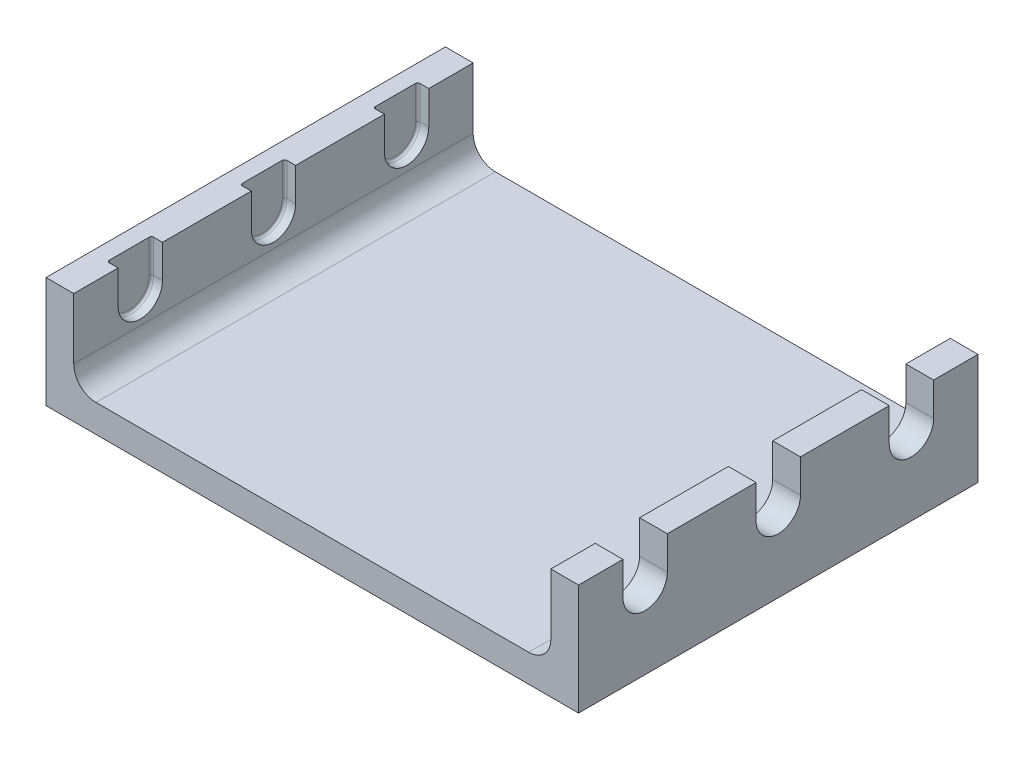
ISO-10303-21;
HEADER;
FILE_DESCRIPTION(('STEP AP214'),'2;1');
FILE_NAME('part.step','',(''),(''),'','','');
FILE_SCHEMA(('AUTOMOTIVE_DESIGN { 1 0 10303 214 1 1 1 1 }'));
ENDSEC;
DATA;
#1=APPLICATION_CONTEXT('core data for automotive mechanical design processes');
#2=APPLICATION_PROTOCOL_DEFINITION('international standard','automotive_design',2000,#1);
#3=PRODUCT_CONTEXT('',#1,'mechanical');
#4=PRODUCT('Part','Part','',(#3));
#5=PRODUCT_RELATED_PRODUCT_CATEGORY('part','',(#4));
#6=PRODUCT_DEFINITION_FORMATION('','',#4);
#7=PRODUCT_DEFINITION_CONTEXT('part definition',#1,'design');
#8=PRODUCT_DEFINITION('design','',#6,#7);
#9=PRODUCT_DEFINITION_SHAPE('','',#8);
#10=(LENGTH_UNIT() NAMED_UNIT(*) SI_UNIT(.MILLI.,.METRE.));
#11=(NAMED_UNIT(*) PLANE_ANGLE_UNIT() SI_UNIT($,.RADIAN.));
#12=(NAMED_UNIT(*) SI_UNIT($,.STERADIAN.) SOLID_ANGLE_UNIT());
#13=UNCERTAINTY_MEASURE_WITH_UNIT(LENGTH_MEASURE(1.E-05),#10,'distance_accuracy_value','');
#14=(GEOMETRIC_REPRESENTATION_CONTEXT(3) GLOBAL_UNCERTAINTY_ASSIGNED_CONTEXT((#13)) GLOBAL_UNIT_ASSIGNED_CONTEXT((#10,
#11,#12)) REPRESENTATION_CONTEXT('',''));
#15=CARTESIAN_POINT('',(0.,0.,0.));
#16=DIRECTION('',(0.,0.,1.));
#17=DIRECTION('',(1.,0.,0.));
#18=AXIS2_PLACEMENT_3D('',#15,#16,#17);
#19=CARTESIAN_POINT('',(273.05,127.,76.2));
#20=DIRECTION('',(0.,-1.,0.));
#21=DIRECTION('',(0.,0.,-1.));
#22=AXIS2_PLACEMENT_3D('',#19,#20,#21);
#23=PLANE('',#22);
#24=DIRECTION('',(0.,0.,-1.));
#25=VECTOR('',#24,1.);
#26=CARTESIAN_POINT('',(273.05,127.,76.2));
#27=LINE('',#26,#25);
#28=CARTESIAN_POINT('',(273.05,127.,-25.4));
#29=VERTEX_POINT('',#28);
#30=CARTESIAN_POINT('',(273.05,127.,-127.));
#31=VERTEX_POINT('',#30);
#32=EDGE_CURVE('E553',#29,#31,#27,.T.);
#33=ORIENTED_EDGE('',*,*,#32,.F.);
#34=DIRECTION('',(1.,0.,0.));
#35=VECTOR('',#34,1.);
#36=CARTESIAN_POINT('',(-304.801,127.,-25.4));
#37=LINE('',#36,#35);
#38=CARTESIAN_POINT('',(304.8,127.,-25.4));
#39=VERTEX_POINT('',#38);
#40=EDGE_CURVE('E487',#29,#39,#37,.T.);
#41=ORIENTED_EDGE('',*,*,#40,.T.);
#42=DIRECTION('',(0.,0.,-1.));
#43=VECTOR('',#42,1.);
#44=CARTESIAN_POINT('',(304.8,127.,76.2));
#45=LINE('',#44,#43);
#46=CARTESIAN_POINT('',(304.8,127.,-127.));
#47=VERTEX_POINT('',#46);
#48=EDGE_CURVE('E557',#39,#47,#45,.T.);
#49=ORIENTED_EDGE('',*,*,#48,.T.);
#50=DIRECTION('',(1.,0.,0.));
#51=VECTOR('',#50,1.);
#52=CARTESIAN_POINT('',(-304.801,127.,-127.));
#53=LINE('',#52,#51);
#54=EDGE_CURVE('E417',#31,#47,#53,.T.);
#55=ORIENTED_EDGE('',*,*,#54,.F.);
#56=EDGE_LOOP('',(#33,#41,#49,#55));
#57=FACE_BOUND('',#56,.T.);
#58=ADVANCED_FACE('F33',(#57),#23,.F.);
#59=CARTESIAN_POINT('',(-304.8,0.,76.2));
#60=DIRECTION('',(1.,0.,0.));
#61=DIRECTION('',(0.,0.,-1.));
#62=AXIS2_PLACEMENT_3D('',#59,#60,#61);
#63=PLANE('',#62);
#64=DIRECTION('',(0.,0.,-1.));
#65=VECTOR('',#64,1.);
#66=CARTESIAN_POINT('',(-304.8,127.,76.2));
#67=LINE('',#66,#65);
#68=CARTESIAN_POINT('',(-304.8,127.,76.2));
#69=VERTEX_POINT('',#68);
#70=CARTESIAN_POINT('',(-304.8,127.,-381.));
#71=VERTEX_POINT('',#70);
#72=EDGE_CURVE('E539',#69,#71,#67,.T.);
#73=ORIENTED_EDGE('',*,*,#72,.T.);
#74=DIRECTION('',(0.,-1.,0.));
#75=VECTOR('',#74,1.);
#76=CARTESIAN_POINT('',(-304.8,0.,-381.));
#77=LINE('',#76,#75);
#78=CARTESIAN_POINT('',(-304.8,0.,-381.));
#79=VERTEX_POINT('',#78);
#80=EDGE_CURVE('E344',#71,#79,#77,.T.);
#81=ORIENTED_EDGE('',*,*,#80,.T.);
#82=DIRECTION('',(0.,0.,-1.));
#83=VECTOR('',#82,1.);
#84=CARTESIAN_POINT('',(-304.8,0.,76.2));
#85=LINE('',#84,#83);
#86=CARTESIAN_POINT('',(-304.8,0.,76.2));
#87=VERTEX_POINT('',#86);
#88=EDGE_CURVE('E563',#87,#79,#85,.T.);
#89=ORIENTED_EDGE('',*,*,#88,.F.);
#90=DIRECTION('',(0.,-1.,0.));
#91=VECTOR('',#90,1.);
#92=CARTESIAN_POINT('',(-304.8,0.,76.2));
#93=LINE('',#92,#91);
#94=EDGE_CURVE('E513',#69,#87,#93,.T.);
#95=ORIENTED_EDGE('',*,*,#94,.F.);
#96=EDGE_LOOP('',(#73,#81,#89,#95));
#97=FACE_BOUND('',#96,.T.);
#98=ADVANCED_FACE('F688',(#97),#63,.F.);
#99=CARTESIAN_POINT('',(-304.8,0.,76.2));
#100=DIRECTION('',(0.,1.,0.));
#101=DIRECTION('',(0.,0.,1.));
#102=AXIS2_PLACEMENT_3D('',#99,#100,#101);
#103=PLANE('',#102);
#104=ORIENTED_EDGE('',*,*,#88,.T.);
#105=DIRECTION('',(1.,0.,0.));
#106=VECTOR('',#105,1.);
#107=CARTESIAN_POINT('',(-304.8,0.,-381.));
#108=LINE('',#107,#106);
#109=CARTESIAN_POINT('',(304.8,0.,-381.));
#110=VERTEX_POINT('',#109);
#111=EDGE_CURVE('E353',#79,#110,#108,.T.);
#112=ORIENTED_EDGE('',*,*,#111,.T.);
#113=DIRECTION('',(0.,0.,-1.));
#114=VECTOR('',#113,1.);
#115=CARTESIAN_POINT('',(304.8,0.,76.2));
#116=LINE('',#115,#114);
#117=CARTESIAN_POINT('',(304.8,0.,76.2));
#118=VERTEX_POINT('',#117);
#119=EDGE_CURVE('E561',#118,#110,#116,.T.);
#120=ORIENTED_EDGE('',*,*,#119,.F.);
#121=DIRECTION('',(1.,0.,0.));
#122=VECTOR('',#121,1.);
#123=CARTESIAN_POINT('',(-304.8,0.,76.2));
#124=LINE('',#123,#122);
#125=EDGE_CURVE('E521',#87,#118,#124,.T.);
#126=ORIENTED_EDGE('',*,*,#125,.F.);
#127=EDGE_LOOP('',(#104,#112,#120,#126));
#128=FACE_BOUND('',#127,.T.);
#129=ADVANCED_FACE('F726',(#128),#103,.F.);
#130=CARTESIAN_POINT('',(304.8,0.,76.2));
#131=DIRECTION('',(-1.,0.,0.));
#132=DIRECTION('',(0.,0.,1.));
#133=AXIS2_PLACEMENT_3D('',#130,#131,#132);
#134=PLANE('',#133);
#135=ORIENTED_EDGE('',*,*,#48,.F.);
#136=DIRECTION('',(0.,1.,0.));
#137=VECTOR('',#136,1.);
#138=CARTESIAN_POINT('',(304.8,88.9,-25.4));
#139=LINE('',#138,#137);
#140=CARTESIAN_POINT('',(304.8,88.9,-25.4));
#141=VERTEX_POINT('',#140);
#142=EDGE_CURVE('E484',#141,#39,#139,.T.);
#143=ORIENTED_EDGE('',*,*,#142,.F.);
#144=CARTESIAN_POINT('',(304.8,88.9,0.));
#145=DIRECTION('',(1.,0.,0.));
#146=DIRECTION('',(0.,0.,-1.));
#147=AXIS2_PLACEMENT_3D('',#144,#145,#146);
#148=CIRCLE('',#147,25.4);
#149=CARTESIAN_POINT('',(304.8,88.9,25.4));
#150=VERTEX_POINT('',#149);
#151=EDGE_CURVE('E481',#150,#141,#148,.T.);
#152=ORIENTED_EDGE('',*,*,#151,.F.);
#153=DIRECTION('',(0.,-1.,0.));
#154=VECTOR('',#153,1.);
#155=CARTESIAN_POINT('',(304.8,127.,25.4));
#156=LINE('',#155,#154);
#157=CARTESIAN_POINT('',(304.8,127.,25.4));
#158=VERTEX_POINT('',#157);
#159=EDGE_CURVE('E478',#158,#150,#156,.T.);
#160=ORIENTED_EDGE('',*,*,#159,.F.);
#161=CARTESIAN_POINT('',(304.8,127.,76.2));
#162=VERTEX_POINT('',#161);
#163=EDGE_CURVE('E558',#162,#158,#45,.T.);
#164=ORIENTED_EDGE('',*,*,#163,.F.);
#165=DIRECTION('',(0.,1.,0.));
#166=VECTOR('',#165,1.);
#167=CARTESIAN_POINT('',(304.8,0.,76.2));
#168=LINE('',#167,#166);
#169=EDGE_CURVE('E523',#118,#162,#168,.T.);
#170=ORIENTED_EDGE('',*,*,#169,.F.);
#171=ORIENTED_EDGE('',*,*,#119,.T.);
#172=DIRECTION('',(0.,1.,0.));
#173=VECTOR('',#172,1.);
#174=CARTESIAN_POINT('',(304.8,0.,-381.));
#175=LINE('',#174,#173);
#176=CARTESIAN_POINT('',(304.8,127.,-381.));
#177=VERTEX_POINT('',#176);
#178=EDGE_CURVE('E356',#110,#177,#175,.T.);
#179=ORIENTED_EDGE('',*,*,#178,.T.);
#180=DIRECTION('',(0.,0.,-1.));
#181=VECTOR('',#180,1.);
#182=CARTESIAN_POINT('',(304.8,127.,-228.6));
#183=LINE('',#182,#181);
#184=CARTESIAN_POINT('',(304.8,127.,-330.2));
#185=VERTEX_POINT('',#184);
#186=EDGE_CURVE('E384',#185,#177,#183,.T.);
#187=ORIENTED_EDGE('',*,*,#186,.F.);
#188=DIRECTION('',(0.,1.,0.));
#189=VECTOR('',#188,1.);
#190=CARTESIAN_POINT('',(304.8,88.9,-330.2));
#191=LINE('',#190,#189);
#192=CARTESIAN_POINT('',(304.8,88.9,-330.2));
#193=VERTEX_POINT('',#192);
#194=EDGE_CURVE('E320',#193,#185,#191,.T.);
#195=ORIENTED_EDGE('',*,*,#194,.F.);
#196=CARTESIAN_POINT('',(304.8,88.9,-304.8));
#197=DIRECTION('',(1.,0.,0.));
#198=DIRECTION('',(0.,0.,-1.));
#199=AXIS2_PLACEMENT_3D('',#196,#197,#198);
#200=CIRCLE('',#199,25.4);
#201=CARTESIAN_POINT('',(304.8,88.9,-279.4));
#202=VERTEX_POINT('',#201);
#203=EDGE_CURVE('E324',#202,#193,#200,.T.);
#204=ORIENTED_EDGE('',*,*,#203,.F.);
#205=DIRECTION('',(0.,-1.,0.));
#206=VECTOR('',#205,1.);
#207=CARTESIAN_POINT('',(304.8,127.,-279.4));
#208=LINE('',#207,#206);
#209=CARTESIAN_POINT('',(304.8,127.,-279.4));
#210=VERTEX_POINT('',#209);
#211=EDGE_CURVE('E772',#210,#202,#208,.T.);
#212=ORIENTED_EDGE('',*,*,#211,.F.);
#213=DIRECTION('',(0.,0.,-1.));
#214=VECTOR('',#213,1.);
#215=CARTESIAN_POINT('',(304.8,127.,-76.2));
#216=LINE('',#215,#214);
#217=CARTESIAN_POINT('',(304.8,127.,-177.8));
#218=VERTEX_POINT('',#217);
#219=EDGE_CURVE('E304',#218,#210,#216,.T.);
#220=ORIENTED_EDGE('',*,*,#219,.F.);
#221=DIRECTION('',(0.,1.,0.));
#222=VECTOR('',#221,1.);
#223=CARTESIAN_POINT('',(304.8,88.9,-177.8));
#224=LINE('',#223,#222);
#225=CARTESIAN_POINT('',(304.8,88.9,-177.8));
#226=VERTEX_POINT('',#225);
#227=EDGE_CURVE('E415',#226,#218,#224,.T.);
#228=ORIENTED_EDGE('',*,*,#227,.F.);
#229=CARTESIAN_POINT('',(304.8,88.9,-152.4));
#230=DIRECTION('',(1.,0.,0.));
#231=DIRECTION('',(0.,0.,-1.));
#232=AXIS2_PLACEMENT_3D('',#229,#230,#231);
#233=CIRCLE('',#232,25.4);
#234=CARTESIAN_POINT('',(304.8,88.9,-127.));
#235=VERTEX_POINT('',#234);
#236=EDGE_CURVE('E412',#235,#226,#233,.T.);
#237=ORIENTED_EDGE('',*,*,#236,.F.);
#238=DIRECTION('',(0.,-1.,0.));
#239=VECTOR('',#238,1.);
#240=CARTESIAN_POINT('',(304.8,127.,-127.));
#241=LINE('',#240,#239);
#242=EDGE_CURVE('E409',#47,#235,#241,.T.);
#243=ORIENTED_EDGE('',*,*,#242,.F.);
#244=EDGE_LOOP('',(#135,#143,#152,#160,#164,#170,#171,#179,#187,#195,#204,#212,#220,#228,#237,#243));
#245=FACE_BOUND('',#244,.T.);
#246=ADVANCED_FACE('F722',(#245),#134,.F.);
#247=ORIENTED_EDGE('',*,*,#163,.T.);
#248=DIRECTION('',(1.,0.,0.));
#249=VECTOR('',#248,1.);
#250=CARTESIAN_POINT('',(-304.801,127.,25.4));
#251=LINE('',#250,#249);
#252=CARTESIAN_POINT('',(273.05,127.,25.4));
#253=VERTEX_POINT('',#252);
#254=EDGE_CURVE('E486',#253,#158,#251,.T.);
#255=ORIENTED_EDGE('',*,*,#254,.F.);
#256=CARTESIAN_POINT('',(273.05,127.,76.2));
#257=VERTEX_POINT('',#256);
#258=EDGE_CURVE('E554',#257,#253,#27,.T.);
#259=ORIENTED_EDGE('',*,*,#258,.F.);
#260=DIRECTION('',(-1.,0.,0.));
#261=VECTOR('',#260,1.);
#262=CARTESIAN_POINT('',(273.05,127.,76.2));
#263=LINE('',#262,#261);
#264=EDGE_CURVE('E525',#162,#257,#263,.T.);
#265=ORIENTED_EDGE('',*,*,#264,.F.);
#266=EDGE_LOOP('',(#247,#255,#259,#265));
#267=FACE_BOUND('',#266,.T.);
#268=ADVANCED_FACE('F733',(#267),#23,.F.);
#269=CARTESIAN_POINT('',(273.05,57.15,76.2));
#270=DIRECTION('',(1.,0.,0.));
#271=DIRECTION('',(0.,0.,-1.));
#272=AXIS2_PLACEMENT_3D('',#269,#270,#271);
#273=PLANE('',#272);
#274=CARTESIAN_POINT('',(273.05,88.9,0.));
#275=DIRECTION('',(1.,0.,0.));
#276=DIRECTION('',(0.,0.,-1.));
#277=AXIS2_PLACEMENT_3D('',#274,#275,#276);
#278=CIRCLE('',#277,25.4);
#279=CARTESIAN_POINT('',(273.05,88.9,-25.4));
#280=VERTEX_POINT('',#279);
#281=CARTESIAN_POINT('',(273.05,88.9,25.4));
#282=VERTEX_POINT('',#281);
#283=EDGE_CURVE('E50',#280,#282,#278,.F.);
#284=ORIENTED_EDGE('',*,*,#283,.F.);
#285=DIRECTION('',(0.,-1.,0.));
#286=VECTOR('',#285,1.);
#287=CARTESIAN_POINT('',(273.05,88.9,-25.4));
#288=LINE('',#287,#286);
#289=EDGE_CURVE('E475',#29,#280,#288,.T.);
#290=ORIENTED_EDGE('',*,*,#289,.F.);
#291=ORIENTED_EDGE('',*,*,#32,.T.);
#292=DIRECTION('',(0.,1.,0.));
#293=VECTOR('',#292,1.);
#294=CARTESIAN_POINT('',(273.05,127.,-127.));
#295=LINE('',#294,#293);
#296=CARTESIAN_POINT('',(273.05,88.9,-127.));
#297=VERTEX_POINT('',#296);
#298=EDGE_CURVE('E420',#297,#31,#295,.T.);
#299=ORIENTED_EDGE('',*,*,#298,.F.);
#300=CARTESIAN_POINT('',(273.05,88.9,-152.4));
#301=DIRECTION('',(1.,0.,0.));
#302=DIRECTION('',(0.,0.,-1.));
#303=AXIS2_PLACEMENT_3D('',#300,#301,#302);
#304=CIRCLE('',#303,25.4);
#305=CARTESIAN_POINT('',(273.05,88.9,-177.8));
#306=VERTEX_POINT('',#305);
#307=EDGE_CURVE('E403',#306,#297,#304,.F.);
#308=ORIENTED_EDGE('',*,*,#307,.F.);
#309=DIRECTION('',(0.,-1.,0.));
#310=VECTOR('',#309,1.);
#311=CARTESIAN_POINT('',(273.05,88.9,-177.8));
#312=LINE('',#311,#310);
#313=CARTESIAN_POINT('',(273.05,127.,-177.8));
#314=VERTEX_POINT('',#313);
#315=EDGE_CURVE('E300',#314,#306,#312,.T.);
#316=ORIENTED_EDGE('',*,*,#315,.F.);
#317=DIRECTION('',(0.,0.,-1.));
#318=VECTOR('',#317,1.);
#319=CARTESIAN_POINT('',(273.05,127.,-76.2));
#320=LINE('',#319,#318);
#321=CARTESIAN_POINT('',(273.05,127.,-279.4));
#322=VERTEX_POINT('',#321);
#323=EDGE_CURVE('E293',#314,#322,#320,.T.);
#324=ORIENTED_EDGE('',*,*,#323,.T.);
#325=DIRECTION('',(0.,1.,0.));
#326=VECTOR('',#325,1.);
#327=CARTESIAN_POINT('',(273.05,127.,-279.4));
#328=LINE('',#327,#326);
#329=CARTESIAN_POINT('',(273.05,88.9,-279.4));
#330=VERTEX_POINT('',#329);
#331=EDGE_CURVE('E297',#330,#322,#328,.T.);
#332=ORIENTED_EDGE('',*,*,#331,.F.);
#333=CARTESIAN_POINT('',(273.05,88.9,-304.8));
#334=DIRECTION('',(1.,0.,0.));
#335=DIRECTION('',(0.,0.,-1.));
#336=AXIS2_PLACEMENT_3D('',#333,#334,#335);
#337=CIRCLE('',#336,25.4);
#338=CARTESIAN_POINT('',(273.05,88.9,-330.2));
#339=VERTEX_POINT('',#338);
#340=EDGE_CURVE('E778',#339,#330,#337,.F.);
#341=ORIENTED_EDGE('',*,*,#340,.F.);
#342=DIRECTION('',(0.,-1.,0.));
#343=VECTOR('',#342,1.);
#344=CARTESIAN_POINT('',(273.05,88.9,-330.2));
#345=LINE('',#344,#343);
#346=CARTESIAN_POINT('',(273.05,127.,-330.2));
#347=VERTEX_POINT('',#346);
#348=EDGE_CURVE('E774',#347,#339,#345,.T.);
#349=ORIENTED_EDGE('',*,*,#348,.F.);
#350=DIRECTION('',(0.,0.,-1.));
#351=VECTOR('',#350,1.);
#352=CARTESIAN_POINT('',(273.05,127.,-228.6));
#353=LINE('',#352,#351);
#354=CARTESIAN_POINT('',(273.05,127.,-381.));
#355=VERTEX_POINT('',#354);
#356=EDGE_CURVE('E382',#347,#355,#353,.T.);
#357=ORIENTED_EDGE('',*,*,#356,.T.);
#358=DIRECTION('',(0.,-1.,0.));
#359=VECTOR('',#358,1.);
#360=CARTESIAN_POINT('',(273.05,57.15,-381.));
#361=LINE('',#360,#359);
#362=CARTESIAN_POINT('',(273.05,57.15,-381.));
#363=VERTEX_POINT('',#362);
#364=EDGE_CURVE('E362',#355,#363,#361,.T.);
#365=ORIENTED_EDGE('',*,*,#364,.T.);
#366=DIRECTION('',(0.,0.,-1.));
#367=VECTOR('',#366,1.);
#368=CARTESIAN_POINT('',(273.05,57.15,76.2));
#369=LINE('',#368,#367);
#370=CARTESIAN_POINT('',(273.05,57.15,76.2));
#371=VERTEX_POINT('',#370);
#372=EDGE_CURVE('E551',#371,#363,#369,.T.);
#373=ORIENTED_EDGE('',*,*,#372,.F.);
#374=DIRECTION('',(0.,-1.,0.));
#375=VECTOR('',#374,1.);
#376=CARTESIAN_POINT('',(273.05,57.15,76.2));
#377=LINE('',#376,#375);
#378=EDGE_CURVE('E527',#257,#371,#377,.T.);
#379=ORIENTED_EDGE('',*,*,#378,.F.);
#380=ORIENTED_EDGE('',*,*,#258,.T.);
#381=DIRECTION('',(0.,1.,0.));
#382=VECTOR('',#381,1.);
#383=CARTESIAN_POINT('',(273.05,127.,25.4));
#384=LINE('',#383,#382);
#385=EDGE_CURVE('E490',#282,#253,#384,.T.);
#386=ORIENTED_EDGE('',*,*,#385,.F.);
#387=EDGE_LOOP('',(#284,#290,#291,#299,#308,#316,#324,#332,#341,#349,#357,#365,#373,#379,#380,#386));
#388=FACE_BOUND('',#387,.T.);
#389=ADVANCED_FACE('F295',(#388),#273,.F.);
#390=CARTESIAN_POINT('',(247.65,57.15,76.2));
#391=DIRECTION('',(0.,0.,-1.));
#392=DIRECTION('',(-1.,0.,0.));
#393=AXIS2_PLACEMENT_3D('',#390,#391,#392);
#394=CYLINDRICAL_SURFACE('',#393,25.4);
#395=ORIENTED_EDGE('',*,*,#372,.T.);
#396=CARTESIAN_POINT('',(247.65,57.15,-381.));
#397=DIRECTION('',(0.,0.,-1.));
#398=DIRECTION('',(-1.,0.,0.));
#399=AXIS2_PLACEMENT_3D('',#396,#397,#398);
#400=CIRCLE('',#399,25.4);
#401=CARTESIAN_POINT('',(247.65,31.75,-381.));
#402=VERTEX_POINT('',#401);
#403=EDGE_CURVE('E365',#363,#402,#400,.T.);
#404=ORIENTED_EDGE('',*,*,#403,.T.);
#405=DIRECTION('',(0.,0.,-1.));
#406=VECTOR('',#405,1.);
#407=CARTESIAN_POINT('',(247.65,31.75,76.2));
#408=LINE('',#407,#406);
#409=CARTESIAN_POINT('',(247.65,31.75,76.2));
#410=VERTEX_POINT('',#409);
#411=EDGE_CURVE('E549',#410,#402,#408,.T.);
#412=ORIENTED_EDGE('',*,*,#411,.F.);
#413=CARTESIAN_POINT('',(247.65,57.15,76.2));
#414=DIRECTION('',(0.,0.,-1.));
#415=DIRECTION('',(-1.,0.,0.));
#416=AXIS2_PLACEMENT_3D('',#413,#414,#415);
#417=CIRCLE('',#416,25.4);
#418=EDGE_CURVE('E529',#371,#410,#417,.T.);
#419=ORIENTED_EDGE('',*,*,#418,.F.);
#420=EDGE_LOOP('',(#395,#404,#412,#419));
#421=FACE_BOUND('',#420,.T.);
#422=ADVANCED_FACE('F709',(#421),#394,.F.);
#423=CARTESIAN_POINT('',(-247.65,31.75,76.2));
#424=DIRECTION('',(0.,-1.,0.));
#425=DIRECTION('',(0.,0.,-1.));
#426=AXIS2_PLACEMENT_3D('',#423,#424,#425);
#427=PLANE('',#426);
#428=ORIENTED_EDGE('',*,*,#411,.T.);
#429=DIRECTION('',(-1.,0.,0.));
#430=VECTOR('',#429,1.);
#431=CARTESIAN_POINT('',(-247.65,31.75,-381.));
#432=LINE('',#431,#430);
#433=CARTESIAN_POINT('',(-247.65,31.75,-381.));
#434=VERTEX_POINT('',#433);
#435=EDGE_CURVE('E368',#402,#434,#432,.T.);
#436=ORIENTED_EDGE('',*,*,#435,.T.);
#437=DIRECTION('',(0.,0.,-1.));
#438=VECTOR('',#437,1.);
#439=CARTESIAN_POINT('',(-247.65,31.75,76.2));
#440=LINE('',#439,#438);
#441=CARTESIAN_POINT('',(-247.65,31.75,76.2));
#442=VERTEX_POINT('',#441);
#443=EDGE_CURVE('E547',#442,#434,#440,.T.);
#444=ORIENTED_EDGE('',*,*,#443,.F.);
#445=DIRECTION('',(-1.,0.,0.));
#446=VECTOR('',#445,1.);
#447=CARTESIAN_POINT('',(-247.65,31.75,76.2));
#448=LINE('',#447,#446);
#449=EDGE_CURVE('E531',#410,#442,#448,.T.);
#450=ORIENTED_EDGE('',*,*,#449,.F.);
#451=EDGE_LOOP('',(#428,#436,#444,#450));
#452=FACE_BOUND('',#451,.T.);
#453=ADVANCED_FACE('F704',(#452),#427,.F.);
#454=CARTESIAN_POINT('',(-247.65,57.15,76.2));
#455=DIRECTION('',(0.,0.,-1.));
#456=DIRECTION('',(-1.,0.,0.));
#457=AXIS2_PLACEMENT_3D('',#454,#455,#456);
#458=CYLINDRICAL_SURFACE('',#457,25.4);
#459=ORIENTED_EDGE('',*,*,#443,.T.);
#460=CARTESIAN_POINT('',(-247.65,57.15,-381.));
#461=DIRECTION('',(0.,0.,-1.));
#462=DIRECTION('',(-1.,0.,0.));
#463=AXIS2_PLACEMENT_3D('',#460,#461,#462);
#464=CIRCLE('',#463,25.4);
#465=CARTESIAN_POINT('',(-273.05,57.15,-381.));
#466=VERTEX_POINT('',#465);
#467=EDGE_CURVE('E371',#434,#466,#464,.T.);
#468=ORIENTED_EDGE('',*,*,#467,.T.);
#469=DIRECTION('',(0.,0.,-1.));
#470=VECTOR('',#469,1.);
#471=CARTESIAN_POINT('',(-273.05,57.15,76.2));
#472=LINE('',#471,#470);
#473=CARTESIAN_POINT('',(-273.05,57.15,76.2));
#474=VERTEX_POINT('',#473);
#475=EDGE_CURVE('E545',#474,#466,#472,.T.);
#476=ORIENTED_EDGE('',*,*,#475,.F.);
#477=CARTESIAN_POINT('',(-247.65,57.15,76.2));
#478=DIRECTION('',(0.,0.,-1.));
#479=DIRECTION('',(-1.,0.,0.));
#480=AXIS2_PLACEMENT_3D('',#477,#478,#479);
#481=CIRCLE('',#480,25.4);
#482=EDGE_CURVE('E533',#442,#474,#481,.T.);
#483=ORIENTED_EDGE('',*,*,#482,.F.);
#484=EDGE_LOOP('',(#459,#468,#476,#483));
#485=FACE_BOUND('',#484,.T.);
#486=ADVANCED_FACE('F698',(#485),#458,.F.);
#487=CARTESIAN_POINT('',(-273.05,57.15,76.2));
#488=DIRECTION('',(-1.,0.,0.));
#489=DIRECTION('',(0.,0.,1.));
#490=AXIS2_PLACEMENT_3D('',#487,#488,#489);
#491=PLANE('',#490);
#492=DIRECTION('',(0.,0.,-1.));
#493=VECTOR('',#492,1.);
#494=CARTESIAN_POINT('',(-273.05,127.,76.2));
#495=LINE('',#494,#493);
#496=CARTESIAN_POINT('',(-273.05,127.,-25.4));
#497=VERTEX_POINT('',#496);
#498=CARTESIAN_POINT('',(-273.05,127.,-127.));
#499=VERTEX_POINT('',#498);
#500=EDGE_CURVE('E541',#497,#499,#495,.T.);
#501=ORIENTED_EDGE('',*,*,#500,.F.);
#502=DIRECTION('',(0.,1.,0.));
#503=VECTOR('',#502,1.);
#504=CARTESIAN_POINT('',(-273.05,88.9,-25.4));
#505=LINE('',#504,#503);
#506=CARTESIAN_POINT('',(-273.05,88.9,-25.4));
#507=VERTEX_POINT('',#506);
#508=EDGE_CURVE('E502',#507,#497,#505,.T.);
#509=ORIENTED_EDGE('',*,*,#508,.F.);
#510=CARTESIAN_POINT('',(-273.05,88.9,0.));
#511=DIRECTION('',(1.,0.,0.));
#512=DIRECTION('',(0.,0.,-1.));
#513=AXIS2_PLACEMENT_3D('',#510,#511,#512);
#514=CIRCLE('',#513,25.4);
#515=CARTESIAN_POINT('',(-273.05,88.9,25.4));
#516=VERTEX_POINT('',#515);
#517=EDGE_CURVE('E506',#516,#507,#514,.T.);
#518=ORIENTED_EDGE('',*,*,#517,.F.);
#519=DIRECTION('',(0.,-1.,0.));
#520=VECTOR('',#519,1.);
#521=CARTESIAN_POINT('',(-273.05,127.,25.4));
#522=LINE('',#521,#520);
#523=CARTESIAN_POINT('',(-273.05,127.,25.4));
#524=VERTEX_POINT('',#523);
#525=EDGE_CURVE('E503',#524,#516,#522,.T.);
#526=ORIENTED_EDGE('',*,*,#525,.F.);
#527=CARTESIAN_POINT('',(-273.05,127.,76.2));
#528=VERTEX_POINT('',#527);
#529=EDGE_CURVE('E542',#528,#524,#495,.T.);
#530=ORIENTED_EDGE('',*,*,#529,.F.);
#531=DIRECTION('',(0.,1.,0.));
#532=VECTOR('',#531,1.);
#533=CARTESIAN_POINT('',(-273.05,57.15,76.2));
#534=LINE('',#533,#532);
#535=EDGE_CURVE('E535',#474,#528,#534,.T.);
#536=ORIENTED_EDGE('',*,*,#535,.F.);
#537=ORIENTED_EDGE('',*,*,#475,.T.);
#538=DIRECTION('',(0.,1.,0.));
#539=VECTOR('',#538,1.);
#540=CARTESIAN_POINT('',(-273.05,57.15,-381.));
#541=LINE('',#540,#539);
#542=CARTESIAN_POINT('',(-273.05,127.,-381.));
#543=VERTEX_POINT('',#542);
#544=EDGE_CURVE('E374',#466,#543,#541,.T.);
#545=ORIENTED_EDGE('',*,*,#544,.T.);
#546=DIRECTION('',(0.,0.,-1.));
#547=VECTOR('',#546,1.);
#548=CARTESIAN_POINT('',(-273.05,127.,-228.6));
#549=LINE('',#548,#547);
#550=CARTESIAN_POINT('',(-273.05,127.,-330.2));
#551=VERTEX_POINT('',#550);
#552=EDGE_CURVE('E380',#551,#543,#549,.T.);
#553=ORIENTED_EDGE('',*,*,#552,.F.);
#554=DIRECTION('',(0.,1.,0.));
#555=VECTOR('',#554,1.);
#556=CARTESIAN_POINT('',(-273.05,88.9,-330.2));
#557=LINE('',#556,#555);
#558=CARTESIAN_POINT('',(-273.05,88.9,-330.2));
#559=VERTEX_POINT('',#558);
#560=EDGE_CURVE('E332',#559,#551,#557,.T.);
#561=ORIENTED_EDGE('',*,*,#560,.F.);
#562=CARTESIAN_POINT('',(-273.05,88.9,-304.8));
#563=DIRECTION('',(1.,0.,0.));
#564=DIRECTION('',(0.,0.,-1.));
#565=AXIS2_PLACEMENT_3D('',#562,#563,#564);
#566=CIRCLE('',#565,25.4);
#567=CARTESIAN_POINT('',(-273.05,88.9,-279.4));
#568=VERTEX_POINT('',#567);
#569=EDGE_CURVE('E336',#568,#559,#566,.T.);
#570=ORIENTED_EDGE('',*,*,#569,.F.);
#571=DIRECTION('',(0.,-1.,0.));
#572=VECTOR('',#571,1.);
#573=CARTESIAN_POINT('',(-273.05,127.,-279.4));
#574=LINE('',#573,#572);
#575=CARTESIAN_POINT('',(-273.05,127.,-279.4));
#576=VERTEX_POINT('',#575);
#577=EDGE_CURVE('E333',#576,#568,#574,.T.);
#578=ORIENTED_EDGE('',*,*,#577,.F.);
#579=DIRECTION('',(0.,0.,-1.));
#580=VECTOR('',#579,1.);
#581=CARTESIAN_POINT('',(-273.05,127.,-76.2));
#582=LINE('',#581,#580);
#583=CARTESIAN_POINT('',(-273.05,127.,-177.8));
#584=VERTEX_POINT('',#583);
#585=EDGE_CURVE('E305',#584,#576,#582,.T.);
#586=ORIENTED_EDGE('',*,*,#585,.F.);
#587=DIRECTION('',(0.,1.,0.));
#588=VECTOR('',#587,1.);
#589=CARTESIAN_POINT('',(-273.05,88.9,-177.8));
#590=LINE('',#589,#588);
#591=CARTESIAN_POINT('',(-273.05,88.9,-177.8));
#592=VERTEX_POINT('',#591);
#593=EDGE_CURVE('E434',#592,#584,#590,.T.);
#594=ORIENTED_EDGE('',*,*,#593,.F.);
#595=CARTESIAN_POINT('',(-273.05,88.9,-152.4));
#596=DIRECTION('',(1.,0.,0.));
#597=DIRECTION('',(0.,0.,-1.));
#598=AXIS2_PLACEMENT_3D('',#595,#596,#597);
#599=CIRCLE('',#598,25.4);
#600=CARTESIAN_POINT('',(-273.05,88.9,-127.));
#601=VERTEX_POINT('',#600);
#602=EDGE_CURVE('E438',#601,#592,#599,.T.);
#603=ORIENTED_EDGE('',*,*,#602,.F.);
#604=DIRECTION('',(0.,-1.,0.));
#605=VECTOR('',#604,1.);
#606=CARTESIAN_POINT('',(-273.05,127.,-127.));
#607=LINE('',#606,#605);
#608=EDGE_CURVE('E435',#499,#601,#607,.T.);
#609=ORIENTED_EDGE('',*,*,#608,.F.);
#610=EDGE_LOOP('',(#501,#509,#518,#526,#530,#536,#537,#545,#553,#561,#570,#578,#586,#594,#603,#609));
#611=FACE_BOUND('',#610,.T.);
#612=ADVANCED_FACE('F610',(#611),#491,.F.);
#613=CARTESIAN_POINT('',(-304.8,127.,76.2));
#614=DIRECTION('',(0.,-1.,0.));
#615=DIRECTION('',(0.,0.,-1.));
#616=AXIS2_PLACEMENT_3D('',#613,#614,#615);
#617=PLANE('',#616);
#618=DIRECTION('',(0.,0.,1.));
#619=VECTOR('',#618,1.);
#620=CARTESIAN_POINT('',(-285.75,127.,-25.4));
#621=LINE('',#620,#619);
#622=CARTESIAN_POINT('',(-285.75,127.,-22.86));
#623=VERTEX_POINT('',#622);
#624=CARTESIAN_POINT('',(-285.75,127.,22.86));
#625=VERTEX_POINT('',#624);
#626=EDGE_CURVE('E498',#623,#625,#621,.T.);
#627=ORIENTED_EDGE('',*,*,#626,.F.);
#628=CARTESIAN_POINT('',(-283.21,127.,-22.86));
#629=DIRECTION('',(0.,-1.,0.));
#630=DIRECTION('',(0.,0.,-1.));
#631=AXIS2_PLACEMENT_3D('',#628,#629,#630);
#632=CIRCLE('',#631,2.54);
#633=CARTESIAN_POINT('',(-283.21,127.,-25.4));
#634=VERTEX_POINT('',#633);
#635=EDGE_CURVE('E11',#623,#634,#632,.T.);
#636=ORIENTED_EDGE('',*,*,#635,.T.);
#637=DIRECTION('',(1.,0.,0.));
#638=VECTOR('',#637,1.);
#639=CARTESIAN_POINT('',(-285.75,127.,-25.4));
#640=LINE('',#639,#638);
#641=EDGE_CURVE('E511',#634,#497,#640,.T.);
#642=ORIENTED_EDGE('',*,*,#641,.T.);
#643=ORIENTED_EDGE('',*,*,#500,.T.);
#644=DIRECTION('',(1.,0.,0.));
#645=VECTOR('',#644,1.);
#646=CARTESIAN_POINT('',(-285.75,127.,-127.));
#647=LINE('',#646,#645);
#648=CARTESIAN_POINT('',(-283.21,127.,-127.));
#649=VERTEX_POINT('',#648);
#650=EDGE_CURVE('E433',#649,#499,#647,.T.);
#651=ORIENTED_EDGE('',*,*,#650,.F.);
#652=CARTESIAN_POINT('',(-283.21,127.,-129.54));
#653=DIRECTION('',(0.,-1.,0.));
#654=DIRECTION('',(0.,0.,-1.));
#655=AXIS2_PLACEMENT_3D('',#652,#653,#654);
#656=CIRCLE('',#655,2.54);
#657=CARTESIAN_POINT('',(-285.75,127.,-129.54));
#658=VERTEX_POINT('',#657);
#659=EDGE_CURVE('E467',#649,#658,#656,.T.);
#660=ORIENTED_EDGE('',*,*,#659,.T.);
#661=DIRECTION('',(0.,0.,1.));
#662=VECTOR('',#661,1.);
#663=CARTESIAN_POINT('',(-285.75,127.,-177.8));
#664=LINE('',#663,#662);
#665=CARTESIAN_POINT('',(-285.75,127.,-175.26));
#666=VERTEX_POINT('',#665);
#667=EDGE_CURVE('E430',#666,#658,#664,.T.);
#668=ORIENTED_EDGE('',*,*,#667,.F.);
#669=CARTESIAN_POINT('',(-283.21,127.,-175.26));
#670=DIRECTION('',(0.,-1.,0.));
#671=DIRECTION('',(0.,0.,-1.));
#672=AXIS2_PLACEMENT_3D('',#669,#670,#671);
#673=CIRCLE('',#672,2.54);
#674=CARTESIAN_POINT('',(-283.21,127.,-177.8));
#675=VERTEX_POINT('',#674);
#676=EDGE_CURVE('E469',#666,#675,#673,.T.);
#677=ORIENTED_EDGE('',*,*,#676,.T.);
#678=DIRECTION('',(1.,0.,0.));
#679=VECTOR('',#678,1.);
#680=CARTESIAN_POINT('',(-285.75,127.,-177.8));
#681=LINE('',#680,#679);
#682=EDGE_CURVE('E444',#675,#584,#681,.T.);
#683=ORIENTED_EDGE('',*,*,#682,.T.);
#684=ORIENTED_EDGE('',*,*,#585,.T.);
#685=DIRECTION('',(1.,0.,0.));
#686=VECTOR('',#685,1.);
#687=CARTESIAN_POINT('',(-285.75,127.,-279.4));
#688=LINE('',#687,#686);
#689=CARTESIAN_POINT('',(-283.21,127.,-279.4));
#690=VERTEX_POINT('',#689);
#691=EDGE_CURVE('E331',#690,#576,#688,.T.);
#692=ORIENTED_EDGE('',*,*,#691,.F.);
#693=CARTESIAN_POINT('',(-283.21,127.,-281.94));
#694=DIRECTION('',(0.,-1.,0.));
#695=DIRECTION('',(0.,0.,-1.));
#696=AXIS2_PLACEMENT_3D('',#693,#694,#695);
#697=CIRCLE('',#696,2.54);
#698=CARTESIAN_POINT('',(-285.75,127.,-281.94));
#699=VERTEX_POINT('',#698);
#700=EDGE_CURVE('E399',#690,#699,#697,.T.);
#701=ORIENTED_EDGE('',*,*,#700,.T.);
#702=DIRECTION('',(0.,0.,1.));
#703=VECTOR('',#702,1.);
#704=CARTESIAN_POINT('',(-285.75,127.,-330.2));
#705=LINE('',#704,#703);
#706=CARTESIAN_POINT('',(-285.75,127.,-327.66));
#707=VERTEX_POINT('',#706);
#708=EDGE_CURVE('E328',#707,#699,#705,.T.);
#709=ORIENTED_EDGE('',*,*,#708,.F.);
#710=CARTESIAN_POINT('',(-283.21,127.,-327.66));
#711=DIRECTION('',(0.,-1.,0.));
#712=DIRECTION('',(0.,0.,-1.));
#713=AXIS2_PLACEMENT_3D('',#710,#711,#712);
#714=CIRCLE('',#713,2.54);
#715=CARTESIAN_POINT('',(-283.21,127.,-330.2));
#716=VERTEX_POINT('',#715);
#717=EDGE_CURVE('E401',#707,#716,#714,.T.);
#718=ORIENTED_EDGE('',*,*,#717,.T.);
#719=DIRECTION('',(1.,0.,0.));
#720=VECTOR('',#719,1.);
#721=CARTESIAN_POINT('',(-285.75,127.,-330.2));
#722=LINE('',#721,#720);
#723=EDGE_CURVE('E342',#716,#551,#722,.T.);
#724=ORIENTED_EDGE('',*,*,#723,.T.);
#725=ORIENTED_EDGE('',*,*,#552,.T.);
#726=DIRECTION('',(-1.,0.,0.));
#727=VECTOR('',#726,1.);
#728=CARTESIAN_POINT('',(-304.8,127.,-381.));
#729=LINE('',#728,#727);
#730=EDGE_CURVE('E377',#543,#71,#729,.T.);
#731=ORIENTED_EDGE('',*,*,#730,.T.);
#732=ORIENTED_EDGE('',*,*,#72,.F.);
#733=DIRECTION('',(-1.,0.,0.));
#734=VECTOR('',#733,1.);
#735=CARTESIAN_POINT('',(-304.8,127.,76.2));
#736=LINE('',#735,#734);
#737=EDGE_CURVE('E537',#528,#69,#736,.T.);
#738=ORIENTED_EDGE('',*,*,#737,.F.);
#739=ORIENTED_EDGE('',*,*,#529,.T.);
#740=DIRECTION('',(1.,0.,0.));
#741=VECTOR('',#740,1.);
#742=CARTESIAN_POINT('',(-285.75,127.,25.4));
#743=LINE('',#742,#741);
#744=CARTESIAN_POINT('',(-283.21,127.,25.4));
#745=VERTEX_POINT('',#744);
#746=EDGE_CURVE('E501',#745,#524,#743,.T.);
#747=ORIENTED_EDGE('',*,*,#746,.F.);
#748=CARTESIAN_POINT('',(-283.21,127.,22.86));
#749=DIRECTION('',(0.,-1.,0.));
#750=DIRECTION('',(0.,0.,-1.));
#751=AXIS2_PLACEMENT_3D('',#748,#749,#750);
#752=CIRCLE('',#751,2.54);
#753=EDGE_CURVE('E42',#745,#625,#752,.T.);
#754=ORIENTED_EDGE('',*,*,#753,.T.);
#755=EDGE_LOOP('',(#627,#636,#642,#643,#651,#660,#668,#677,#683,#684,#692,#701,#709,#718,#724,
#725,#731,#732,#738,#739,#747,#754));
#756=FACE_BOUND('',#755,.T.);
#757=ADVANCED_FACE('F594',(#756),#617,.F.);
#758=CARTESIAN_POINT('',(-247.65,57.15,76.2));
#759=DIRECTION('',(0.,0.,-1.));
#760=DIRECTION('',(-1.,0.,0.));
#761=AXIS2_PLACEMENT_3D('',#758,#759,#760);
#762=PLANE('',#761);
#763=ORIENTED_EDGE('',*,*,#94,.T.);
#764=ORIENTED_EDGE('',*,*,#125,.T.);
#765=ORIENTED_EDGE('',*,*,#169,.T.);
#766=ORIENTED_EDGE('',*,*,#264,.T.);
#767=ORIENTED_EDGE('',*,*,#378,.T.);
#768=ORIENTED_EDGE('',*,*,#418,.T.);
#769=ORIENTED_EDGE('',*,*,#449,.T.);
#770=ORIENTED_EDGE('',*,*,#482,.T.);
#771=ORIENTED_EDGE('',*,*,#535,.T.);
#772=ORIENTED_EDGE('',*,*,#737,.T.);
#773=EDGE_LOOP('',(#763,#764,#765,#766,#767,#768,#769,#770,#771,#772));
#774=FACE_BOUND('',#773,.T.);
#775=ADVANCED_FACE('F690',(#774),#762,.F.);
#776=CARTESIAN_POINT('',(-285.75,88.9,-25.4));
#777=DIRECTION('',(0.,0.,-1.));
#778=DIRECTION('',(0.,1.,0.));
#779=AXIS2_PLACEMENT_3D('',#776,#777,#778);
#780=PLANE('',#779);
#781=ORIENTED_EDGE('',*,*,#641,.F.);
#782=DIRECTION('',(0.,1.,0.));
#783=VECTOR('',#782,1.);
#784=CARTESIAN_POINT('',(-283.21,88.9,-25.4));
#785=LINE('',#784,#783);
#786=CARTESIAN_POINT('',(-283.21,88.9,-25.4));
#787=VERTEX_POINT('',#786);
#788=EDGE_CURVE('E58',#634,#787,#785,.F.);
#789=ORIENTED_EDGE('',*,*,#788,.T.);
#790=DIRECTION('',(1.,0.,0.));
#791=VECTOR('',#790,1.);
#792=CARTESIAN_POINT('',(-285.75,88.9,-25.4));
#793=LINE('',#792,#791);
#794=EDGE_CURVE('E514',#787,#507,#793,.T.);
#795=ORIENTED_EDGE('',*,*,#794,.T.);
#796=ORIENTED_EDGE('',*,*,#508,.T.);
#797=EDGE_LOOP('',(#781,#789,#795,#796));
#798=FACE_BOUND('',#797,.T.);
#799=ADVANCED_FACE('F606',(#798),#780,.F.);
#800=CARTESIAN_POINT('',(-285.75,88.9,0.));
#801=DIRECTION('',(1.,0.,0.));
#802=DIRECTION('',(0.,0.,-1.));
#803=AXIS2_PLACEMENT_3D('',#800,#801,#802);
#804=CYLINDRICAL_SURFACE('',#803,25.4);
#805=ORIENTED_EDGE('',*,*,#794,.F.);
#806=CARTESIAN_POINT('',(-283.21,88.9,0.));
#807=DIRECTION('',(1.,0.,0.));
#808=DIRECTION('',(0.,0.,-1.));
#809=AXIS2_PLACEMENT_3D('',#806,#807,#808);
#810=CIRCLE('',#809,25.4);
#811=CARTESIAN_POINT('',(-283.21,88.9,25.4));
#812=VERTEX_POINT('',#811);
#813=EDGE_CURVE('E575',#787,#812,#810,.F.);
#814=ORIENTED_EDGE('',*,*,#813,.T.);
#815=DIRECTION('',(1.,0.,0.));
#816=VECTOR('',#815,1.);
#817=CARTESIAN_POINT('',(-285.75,88.9,25.4));
#818=LINE('',#817,#816);
#819=EDGE_CURVE('E516',#812,#516,#818,.T.);
#820=ORIENTED_EDGE('',*,*,#819,.T.);
#821=ORIENTED_EDGE('',*,*,#517,.T.);
#822=EDGE_LOOP('',(#805,#814,#820,#821));
#823=FACE_BOUND('',#822,.T.);
#824=ADVANCED_FACE('F604',(#823),#804,.F.);
#825=CARTESIAN_POINT('',(-285.75,127.,25.4));
#826=DIRECTION('',(0.,0.,1.));
#827=DIRECTION('',(0.,-1.,0.));
#828=AXIS2_PLACEMENT_3D('',#825,#826,#827);
#829=PLANE('',#828);
#830=ORIENTED_EDGE('',*,*,#819,.F.);
#831=DIRECTION('',(0.,-1.,0.));
#832=VECTOR('',#831,1.);
#833=CARTESIAN_POINT('',(-283.21,127.,25.4));
#834=LINE('',#833,#832);
#835=EDGE_CURVE('E572',#812,#745,#834,.F.);
#836=ORIENTED_EDGE('',*,*,#835,.T.);
#837=ORIENTED_EDGE('',*,*,#746,.T.);
#838=ORIENTED_EDGE('',*,*,#525,.T.);
#839=EDGE_LOOP('',(#830,#836,#837,#838));
#840=FACE_BOUND('',#839,.T.);
#841=ADVANCED_FACE('F600',(#840),#829,.F.);
#842=CARTESIAN_POINT('',(-285.75,88.9,0.));
#843=DIRECTION('',(1.,0.,0.));
#844=DIRECTION('',(0.,0.,-1.));
#845=AXIS2_PLACEMENT_3D('',#842,#843,#844);
#846=PLANE('',#845);
#847=ORIENTED_EDGE('',*,*,#626,.T.);
#848=DIRECTION('',(0.,-1.,0.));
#849=VECTOR('',#848,1.);
#850=CARTESIAN_POINT('',(-285.75,88.9,22.86));
#851=LINE('',#850,#849);
#852=CARTESIAN_POINT('',(-285.75,88.9,22.86));
#853=VERTEX_POINT('',#852);
#854=EDGE_CURVE('E569',#625,#853,#851,.T.);
#855=ORIENTED_EDGE('',*,*,#854,.T.);
#856=CARTESIAN_POINT('',(-285.75,88.9,0.));
#857=DIRECTION('',(1.,0.,0.));
#858=DIRECTION('',(0.,0.,-1.));
#859=AXIS2_PLACEMENT_3D('',#856,#857,#858);
#860=CIRCLE('',#859,22.86);
#861=CARTESIAN_POINT('',(-285.75,88.9,-22.86));
#862=VERTEX_POINT('',#861);
#863=EDGE_CURVE('E565',#853,#862,#860,.T.);
#864=ORIENTED_EDGE('',*,*,#863,.T.);
#865=DIRECTION('',(0.,1.,0.));
#866=VECTOR('',#865,1.);
#867=CARTESIAN_POINT('',(-285.75,88.9,-22.86));
#868=LINE('',#867,#866);
#869=EDGE_CURVE('E567',#862,#623,#868,.T.);
#870=ORIENTED_EDGE('',*,*,#869,.T.);
#871=EDGE_LOOP('',(#847,#855,#864,#870));
#872=FACE_BOUND('',#871,.T.);
#873=ADVANCED_FACE('F592',(#872),#846,.T.);
#874=CARTESIAN_POINT('',(-283.21,88.9,-22.86));
#875=DIRECTION('',(0.,1.,0.));
#876=DIRECTION('',(0.,0.,1.));
#877=AXIS2_PLACEMENT_3D('',#874,#875,#876);
#878=CYLINDRICAL_SURFACE('',#877,2.54);
#879=ORIENTED_EDGE('',*,*,#635,.F.);
#880=ORIENTED_EDGE('',*,*,#869,.F.);
#881=CARTESIAN_POINT('',(-283.21,88.9,-22.86));
#882=DIRECTION('',(0.,1.,0.));
#883=DIRECTION('',(0.,0.,1.));
#884=AXIS2_PLACEMENT_3D('',#881,#882,#883);
#885=CIRCLE('',#884,2.54);
#886=EDGE_CURVE('E37',#787,#862,#885,.T.);
#887=ORIENTED_EDGE('',*,*,#886,.F.);
#888=ORIENTED_EDGE('',*,*,#788,.F.);
#889=EDGE_LOOP('',(#879,#880,#887,#888));
#890=FACE_BOUND('',#889,.T.);
#891=ADVANCED_FACE('F35',(#890),#878,.F.);
#892=CARTESIAN_POINT('',(-283.21,88.9,0.));
#893=DIRECTION('',(1.,0.,0.));
#894=DIRECTION('',(0.,0.,-1.));
#895=AXIS2_PLACEMENT_3D('',#892,#893,#894);
#896=TOROIDAL_SURFACE('',#895,22.86,2.54);
#897=ORIENTED_EDGE('',*,*,#886,.T.);
#898=ORIENTED_EDGE('',*,*,#863,.F.);
#899=CARTESIAN_POINT('',(-283.21,88.9,22.86));
#900=DIRECTION('',(0.,-1.,0.));
#901=DIRECTION('',(0.,0.,-1.));
#902=AXIS2_PLACEMENT_3D('',#899,#900,#901);
#903=CIRCLE('',#902,2.54);
#904=EDGE_CURVE('E497',#812,#853,#903,.T.);
#905=ORIENTED_EDGE('',*,*,#904,.F.);
#906=ORIENTED_EDGE('',*,*,#813,.F.);
#907=EDGE_LOOP('',(#897,#898,#905,#906));
#908=FACE_BOUND('',#907,.T.);
#909=ADVANCED_FACE('F586',(#908),#896,.F.);
#910=CARTESIAN_POINT('',(-283.21,88.9,22.86));
#911=DIRECTION('',(0.,-1.,0.));
#912=DIRECTION('',(0.,0.,-1.));
#913=AXIS2_PLACEMENT_3D('',#910,#911,#912);
#914=CYLINDRICAL_SURFACE('',#913,2.54);
#915=ORIENTED_EDGE('',*,*,#753,.F.);
#916=ORIENTED_EDGE('',*,*,#835,.F.);
#917=ORIENTED_EDGE('',*,*,#904,.T.);
#918=ORIENTED_EDGE('',*,*,#854,.F.);
#919=EDGE_LOOP('',(#915,#916,#917,#918));
#920=FACE_BOUND('',#919,.T.);
#921=ADVANCED_FACE('F597',(#920),#914,.F.);
#922=CARTESIAN_POINT('',(-304.801,88.9,-25.4));
#923=DIRECTION('',(0.,0.,-1.));
#924=DIRECTION('',(-1.,0.,0.));
#925=AXIS2_PLACEMENT_3D('',#922,#923,#924);
#926=PLANE('',#925);
#927=ORIENTED_EDGE('',*,*,#289,.T.);
#928=DIRECTION('',(1.,0.,0.));
#929=VECTOR('',#928,1.);
#930=CARTESIAN_POINT('',(-304.801,88.9,-25.4));
#931=LINE('',#930,#929);
#932=EDGE_CURVE('E491',#280,#141,#931,.T.);
#933=ORIENTED_EDGE('',*,*,#932,.T.);
#934=ORIENTED_EDGE('',*,*,#142,.T.);
#935=ORIENTED_EDGE('',*,*,#40,.F.);
#936=EDGE_LOOP('',(#927,#933,#934,#935));
#937=FACE_BOUND('',#936,.T.);
#938=ADVANCED_FACE('F835',(#937),#926,.F.);
#939=CARTESIAN_POINT('',(-304.801,88.9,0.));
#940=DIRECTION('',(1.,0.,0.));
#941=DIRECTION('',(0.,0.,-1.));
#942=AXIS2_PLACEMENT_3D('',#939,#940,#941);
#943=CYLINDRICAL_SURFACE('',#942,25.4);
#944=ORIENTED_EDGE('',*,*,#283,.T.);
#945=DIRECTION('',(1.,0.,0.));
#946=VECTOR('',#945,1.);
#947=CARTESIAN_POINT('',(-304.801,88.9,25.4));
#948=LINE('',#947,#946);
#949=EDGE_CURVE('E493',#282,#150,#948,.T.);
#950=ORIENTED_EDGE('',*,*,#949,.T.);
#951=ORIENTED_EDGE('',*,*,#151,.T.);
#952=ORIENTED_EDGE('',*,*,#932,.F.);
#953=EDGE_LOOP('',(#944,#950,#951,#952));
#954=FACE_BOUND('',#953,.T.);
#955=ADVANCED_FACE('F838',(#954),#943,.F.);
#956=CARTESIAN_POINT('',(-304.801,127.,25.4));
#957=DIRECTION('',(0.,0.,1.));
#958=DIRECTION('',(0.,-1.,0.));
#959=AXIS2_PLACEMENT_3D('',#956,#957,#958);
#960=PLANE('',#959);
#961=ORIENTED_EDGE('',*,*,#385,.T.);
#962=ORIENTED_EDGE('',*,*,#254,.T.);
#963=ORIENTED_EDGE('',*,*,#159,.T.);
#964=ORIENTED_EDGE('',*,*,#949,.F.);
#965=EDGE_LOOP('',(#961,#962,#963,#964));
#966=FACE_BOUND('',#965,.T.);
#967=ADVANCED_FACE('F755',(#966),#960,.F.);
#968=CARTESIAN_POINT('',(273.05,127.,-76.2));
#969=DIRECTION('',(0.,-1.,0.));
#970=DIRECTION('',(0.,0.,-1.));
#971=AXIS2_PLACEMENT_3D('',#968,#969,#970);
#972=PLANE('',#971);
#973=ORIENTED_EDGE('',*,*,#323,.F.);
#974=DIRECTION('',(1.,0.,0.));
#975=VECTOR('',#974,1.);
#976=CARTESIAN_POINT('',(-304.801,127.,-177.8));
#977=LINE('',#976,#975);
#978=EDGE_CURVE('E418',#314,#218,#977,.T.);
#979=ORIENTED_EDGE('',*,*,#978,.T.);
#980=ORIENTED_EDGE('',*,*,#219,.T.);
#981=DIRECTION('',(1.,0.,0.));
#982=VECTOR('',#981,1.);
#983=CARTESIAN_POINT('',(-304.801,127.,-279.4));
#984=LINE('',#983,#982);
#985=EDGE_CURVE('E312',#322,#210,#984,.T.);
#986=ORIENTED_EDGE('',*,*,#985,.F.);
#987=EDGE_LOOP('',(#973,#979,#980,#986));
#988=FACE_BOUND('',#987,.T.);
#989=ADVANCED_FACE('F318',(#988),#972,.F.);
#990=CARTESIAN_POINT('',(-285.75,88.9,-177.8));
#991=DIRECTION('',(0.,0.,-1.));
#992=DIRECTION('',(0.,1.,0.));
#993=AXIS2_PLACEMENT_3D('',#990,#991,#992);
#994=PLANE('',#993);
#995=ORIENTED_EDGE('',*,*,#682,.F.);
#996=DIRECTION('',(0.,1.,0.));
#997=VECTOR('',#996,1.);
#998=CARTESIAN_POINT('',(-283.21,88.9,-177.8));
#999=LINE('',#998,#997);
#1000=CARTESIAN_POINT('',(-283.21,88.9,-177.8));
#1001=VERTEX_POINT('',#1000);
#1002=EDGE_CURVE('E463',#675,#1001,#999,.F.);
#1003=ORIENTED_EDGE('',*,*,#1002,.T.);
#1004=DIRECTION('',(1.,0.,0.));
#1005=VECTOR('',#1004,1.);
#1006=CARTESIAN_POINT('',(-285.75,88.9,-177.8));
#1007=LINE('',#1006,#1005);
#1008=EDGE_CURVE('E446',#1001,#592,#1007,.T.);
#1009=ORIENTED_EDGE('',*,*,#1008,.T.);
#1010=ORIENTED_EDGE('',*,*,#593,.T.);
#1011=EDGE_LOOP('',(#995,#1003,#1009,#1010));
#1012=FACE_BOUND('',#1011,.T.);
#1013=ADVANCED_FACE('F638',(#1012),#994,.F.);
#1014=CARTESIAN_POINT('',(-285.75,88.9,-152.4));
#1015=DIRECTION('',(1.,0.,0.));
#1016=DIRECTION('',(0.,0.,-1.));
#1017=AXIS2_PLACEMENT_3D('',#1014,#1015,#1016);
#1018=CYLINDRICAL_SURFACE('',#1017,25.4);
#1019=ORIENTED_EDGE('',*,*,#1008,.F.);
#1020=CARTESIAN_POINT('',(-283.21,88.9,-152.4));
#1021=DIRECTION('',(1.,0.,0.));
#1022=DIRECTION('',(0.,0.,-1.));
#1023=AXIS2_PLACEMENT_3D('',#1020,#1021,#1022);
#1024=CIRCLE('',#1023,25.4);
#1025=CARTESIAN_POINT('',(-283.21,88.9,-127.));
#1026=VERTEX_POINT('',#1025);
#1027=EDGE_CURVE('E465',#1001,#1026,#1024,.F.);
#1028=ORIENTED_EDGE('',*,*,#1027,.T.);
#1029=DIRECTION('',(1.,0.,0.));
#1030=VECTOR('',#1029,1.);
#1031=CARTESIAN_POINT('',(-285.75,88.9,-127.));
#1032=LINE('',#1031,#1030);
#1033=EDGE_CURVE('E448',#1026,#601,#1032,.T.);
#1034=ORIENTED_EDGE('',*,*,#1033,.T.);
#1035=ORIENTED_EDGE('',*,*,#602,.T.);
#1036=EDGE_LOOP('',(#1019,#1028,#1034,#1035));
#1037=FACE_BOUND('',#1036,.T.);
#1038=ADVANCED_FACE('F640',(#1037),#1018,.F.);
#1039=CARTESIAN_POINT('',(-285.75,127.,-127.));
#1040=DIRECTION('',(0.,0.,1.));
#1041=DIRECTION('',(0.,-1.,0.));
#1042=AXIS2_PLACEMENT_3D('',#1039,#1040,#1041);
#1043=PLANE('',#1042);
#1044=ORIENTED_EDGE('',*,*,#1033,.F.);
#1045=DIRECTION('',(0.,-1.,0.));
#1046=VECTOR('',#1045,1.);
#1047=CARTESIAN_POINT('',(-283.21,127.,-127.));
#1048=LINE('',#1047,#1046);
#1049=EDGE_CURVE('E461',#1026,#649,#1048,.F.);
#1050=ORIENTED_EDGE('',*,*,#1049,.T.);
#1051=ORIENTED_EDGE('',*,*,#650,.T.);
#1052=ORIENTED_EDGE('',*,*,#608,.T.);
#1053=EDGE_LOOP('',(#1044,#1050,#1051,#1052));
#1054=FACE_BOUND('',#1053,.T.);
#1055=ADVANCED_FACE('F616',(#1054),#1043,.F.);
#1056=CARTESIAN_POINT('',(-285.75,88.9,-152.4));
#1057=DIRECTION('',(1.,0.,0.));
#1058=DIRECTION('',(0.,0.,-1.));
#1059=AXIS2_PLACEMENT_3D('',#1056,#1057,#1058);
#1060=PLANE('',#1059);
#1061=ORIENTED_EDGE('',*,*,#667,.T.);
#1062=DIRECTION('',(0.,-1.,0.));
#1063=VECTOR('',#1062,1.);
#1064=CARTESIAN_POINT('',(-285.75,88.9,-129.54));
#1065=LINE('',#1064,#1063);
#1066=CARTESIAN_POINT('',(-285.75,88.9,-129.54));
#1067=VERTEX_POINT('',#1066);
#1068=EDGE_CURVE('E458',#658,#1067,#1065,.T.);
#1069=ORIENTED_EDGE('',*,*,#1068,.T.);
#1070=CARTESIAN_POINT('',(-285.75,88.9,-152.4));
#1071=DIRECTION('',(1.,0.,0.));
#1072=DIRECTION('',(0.,0.,-1.));
#1073=AXIS2_PLACEMENT_3D('',#1070,#1071,#1072);
#1074=CIRCLE('',#1073,22.86);
#1075=CARTESIAN_POINT('',(-285.75,88.9,-175.26));
#1076=VERTEX_POINT('',#1075);
#1077=EDGE_CURVE('E454',#1067,#1076,#1074,.T.);
#1078=ORIENTED_EDGE('',*,*,#1077,.T.);
#1079=DIRECTION('',(0.,1.,0.));
#1080=VECTOR('',#1079,1.);
#1081=CARTESIAN_POINT('',(-285.75,88.9,-175.26));
#1082=LINE('',#1081,#1080);
#1083=EDGE_CURVE('E456',#1076,#666,#1082,.T.);
#1084=ORIENTED_EDGE('',*,*,#1083,.T.);
#1085=EDGE_LOOP('',(#1061,#1069,#1078,#1084));
#1086=FACE_BOUND('',#1085,.T.);
#1087=ADVANCED_FACE('F629',(#1086),#1060,.T.);
#1088=CARTESIAN_POINT('',(-283.21,88.9,-175.26));
#1089=DIRECTION('',(0.,1.,0.));
#1090=DIRECTION('',(0.,0.,1.));
#1091=AXIS2_PLACEMENT_3D('',#1088,#1089,#1090);
#1092=CYLINDRICAL_SURFACE('',#1091,2.54);
#1093=ORIENTED_EDGE('',*,*,#676,.F.);
#1094=ORIENTED_EDGE('',*,*,#1083,.F.);
#1095=CARTESIAN_POINT('',(-283.21,88.9,-175.26));
#1096=DIRECTION('',(0.,1.,0.));
#1097=DIRECTION('',(0.,0.,1.));
#1098=AXIS2_PLACEMENT_3D('',#1095,#1096,#1097);
#1099=CIRCLE('',#1098,2.54);
#1100=EDGE_CURVE('E439',#1001,#1076,#1099,.T.);
#1101=ORIENTED_EDGE('',*,*,#1100,.F.);
#1102=ORIENTED_EDGE('',*,*,#1002,.F.);
#1103=EDGE_LOOP('',(#1093,#1094,#1101,#1102));
#1104=FACE_BOUND('',#1103,.T.);
#1105=ADVANCED_FACE('F635',(#1104),#1092,.F.);
#1106=CARTESIAN_POINT('',(-283.21,88.9,-152.4));
#1107=DIRECTION('',(1.,0.,0.));
#1108=DIRECTION('',(0.,0.,-1.));
#1109=AXIS2_PLACEMENT_3D('',#1106,#1107,#1108);
#1110=TOROIDAL_SURFACE('',#1109,22.86,2.54);
#1111=ORIENTED_EDGE('',*,*,#1100,.T.);
#1112=ORIENTED_EDGE('',*,*,#1077,.F.);
#1113=CARTESIAN_POINT('',(-283.21,88.9,-129.54));
#1114=DIRECTION('',(0.,-1.,0.));
#1115=DIRECTION('',(0.,0.,-1.));
#1116=AXIS2_PLACEMENT_3D('',#1113,#1114,#1115);
#1117=CIRCLE('',#1116,2.54);
#1118=EDGE_CURVE('E429',#1026,#1067,#1117,.T.);
#1119=ORIENTED_EDGE('',*,*,#1118,.F.);
#1120=ORIENTED_EDGE('',*,*,#1027,.F.);
#1121=EDGE_LOOP('',(#1111,#1112,#1119,#1120));
#1122=FACE_BOUND('',#1121,.T.);
#1123=ADVANCED_FACE('F625',(#1122),#1110,.F.);
#1124=CARTESIAN_POINT('',(-283.21,88.9,-129.54));
#1125=DIRECTION('',(0.,-1.,0.));
#1126=DIRECTION('',(0.,0.,-1.));
#1127=AXIS2_PLACEMENT_3D('',#1124,#1125,#1126);
#1128=CYLINDRICAL_SURFACE('',#1127,2.54);
#1129=ORIENTED_EDGE('',*,*,#659,.F.);
#1130=ORIENTED_EDGE('',*,*,#1049,.F.);
#1131=ORIENTED_EDGE('',*,*,#1118,.T.);
#1132=ORIENTED_EDGE('',*,*,#1068,.F.);
#1133=EDGE_LOOP('',(#1129,#1130,#1131,#1132));
#1134=FACE_BOUND('',#1133,.T.);
#1135=ADVANCED_FACE('F620',(#1134),#1128,.F.);
#1136=CARTESIAN_POINT('',(-304.801,88.9,-177.8));
#1137=DIRECTION('',(0.,0.,-1.));
#1138=DIRECTION('',(-1.,0.,0.));
#1139=AXIS2_PLACEMENT_3D('',#1136,#1137,#1138);
#1140=PLANE('',#1139);
#1141=ORIENTED_EDGE('',*,*,#315,.T.);
#1142=DIRECTION('',(1.,0.,0.));
#1143=VECTOR('',#1142,1.);
#1144=CARTESIAN_POINT('',(-304.801,88.9,-177.8));
#1145=LINE('',#1144,#1143);
#1146=EDGE_CURVE('E421',#306,#226,#1145,.T.);
#1147=ORIENTED_EDGE('',*,*,#1146,.T.);
#1148=ORIENTED_EDGE('',*,*,#227,.T.);
#1149=ORIENTED_EDGE('',*,*,#978,.F.);
#1150=EDGE_LOOP('',(#1141,#1147,#1148,#1149));
#1151=FACE_BOUND('',#1150,.T.);
#1152=ADVANCED_FACE('F770',(#1151),#1140,.F.);
#1153=CARTESIAN_POINT('',(-304.801,88.9,-152.4));
#1154=DIRECTION('',(1.,0.,0.));
#1155=DIRECTION('',(0.,0.,-1.));
#1156=AXIS2_PLACEMENT_3D('',#1153,#1154,#1155);
#1157=CYLINDRICAL_SURFACE('',#1156,25.4);
#1158=ORIENTED_EDGE('',*,*,#307,.T.);
#1159=DIRECTION('',(1.,0.,0.));
#1160=VECTOR('',#1159,1.);
#1161=CARTESIAN_POINT('',(-304.801,88.9,-127.));
#1162=LINE('',#1161,#1160);
#1163=EDGE_CURVE('E423',#297,#235,#1162,.T.);
#1164=ORIENTED_EDGE('',*,*,#1163,.T.);
#1165=ORIENTED_EDGE('',*,*,#236,.T.);
#1166=ORIENTED_EDGE('',*,*,#1146,.F.);
#1167=EDGE_LOOP('',(#1158,#1164,#1165,#1166));
#1168=FACE_BOUND('',#1167,.T.);
#1169=ADVANCED_FACE('F768',(#1168),#1157,.F.);
#1170=CARTESIAN_POINT('',(-304.801,127.,-127.));
#1171=DIRECTION('',(0.,0.,1.));
#1172=DIRECTION('',(0.,-1.,0.));
#1173=AXIS2_PLACEMENT_3D('',#1170,#1171,#1172);
#1174=PLANE('',#1173);
#1175=ORIENTED_EDGE('',*,*,#298,.T.);
#1176=ORIENTED_EDGE('',*,*,#54,.T.);
#1177=ORIENTED_EDGE('',*,*,#242,.T.);
#1178=ORIENTED_EDGE('',*,*,#1163,.F.);
#1179=EDGE_LOOP('',(#1175,#1176,#1177,#1178));
#1180=FACE_BOUND('',#1179,.T.);
#1181=ADVANCED_FACE('F763',(#1180),#1174,.F.);
#1182=CARTESIAN_POINT('',(273.05,127.,-228.6));
#1183=DIRECTION('',(0.,-1.,0.));
#1184=DIRECTION('',(0.,0.,-1.));
#1185=AXIS2_PLACEMENT_3D('',#1182,#1183,#1184);
#1186=PLANE('',#1185);
#1187=ORIENTED_EDGE('',*,*,#356,.F.);
#1188=DIRECTION('',(1.,0.,0.));
#1189=VECTOR('',#1188,1.);
#1190=CARTESIAN_POINT('',(-304.801,127.,-330.2));
#1191=LINE('',#1190,#1189);
#1192=EDGE_CURVE('E316',#347,#185,#1191,.T.);
#1193=ORIENTED_EDGE('',*,*,#1192,.T.);
#1194=ORIENTED_EDGE('',*,*,#186,.T.);
#1195=DIRECTION('',(-1.,0.,0.));
#1196=VECTOR('',#1195,1.);
#1197=CARTESIAN_POINT('',(273.05,127.,-381.));
#1198=LINE('',#1197,#1196);
#1199=EDGE_CURVE('E359',#177,#355,#1198,.T.);
#1200=ORIENTED_EDGE('',*,*,#1199,.T.);
#1201=EDGE_LOOP('',(#1187,#1193,#1194,#1200));
#1202=FACE_BOUND('',#1201,.T.);
#1203=ADVANCED_FACE('F716',(#1202),#1186,.F.);
#1204=CARTESIAN_POINT('',(-247.65,57.15,-381.));
#1205=DIRECTION('',(0.,0.,-1.));
#1206=DIRECTION('',(-1.,0.,0.));
#1207=AXIS2_PLACEMENT_3D('',#1204,#1205,#1206);
#1208=PLANE('',#1207);
#1209=ORIENTED_EDGE('',*,*,#80,.F.);
#1210=ORIENTED_EDGE('',*,*,#730,.F.);
#1211=ORIENTED_EDGE('',*,*,#544,.F.);
#1212=ORIENTED_EDGE('',*,*,#467,.F.);
#1213=ORIENTED_EDGE('',*,*,#435,.F.);
#1214=ORIENTED_EDGE('',*,*,#403,.F.);
#1215=ORIENTED_EDGE('',*,*,#364,.F.);
#1216=ORIENTED_EDGE('',*,*,#1199,.F.);
#1217=ORIENTED_EDGE('',*,*,#178,.F.);
#1218=ORIENTED_EDGE('',*,*,#111,.F.);
#1219=EDGE_LOOP('',(#1209,#1210,#1211,#1212,#1213,#1214,#1215,#1216,#1217,#1218));
#1220=FACE_BOUND('',#1219,.T.);
#1221=ADVANCED_FACE('F684',(#1220),#1208,.T.);
#1222=CARTESIAN_POINT('',(-285.75,88.9,-330.2));
#1223=DIRECTION('',(0.,0.,-1.));
#1224=DIRECTION('',(0.,1.,0.));
#1225=AXIS2_PLACEMENT_3D('',#1222,#1223,#1224);
#1226=PLANE('',#1225);
#1227=ORIENTED_EDGE('',*,*,#723,.F.);
#1228=DIRECTION('',(0.,1.,0.));
#1229=VECTOR('',#1228,1.);
#1230=CARTESIAN_POINT('',(-283.21,88.9,-330.2));
#1231=LINE('',#1230,#1229);
#1232=CARTESIAN_POINT('',(-283.21,88.9,-330.2));
#1233=VERTEX_POINT('',#1232);
#1234=EDGE_CURVE('E395',#716,#1233,#1231,.F.);
#1235=ORIENTED_EDGE('',*,*,#1234,.T.);
#1236=DIRECTION('',(1.,0.,0.));
#1237=VECTOR('',#1236,1.);
#1238=CARTESIAN_POINT('',(-285.75,88.9,-330.2));
#1239=LINE('',#1238,#1237);
#1240=EDGE_CURVE('E345',#1233,#559,#1239,.T.);
#1241=ORIENTED_EDGE('',*,*,#1240,.T.);
#1242=ORIENTED_EDGE('',*,*,#560,.T.);
#1243=EDGE_LOOP('',(#1227,#1235,#1241,#1242));
#1244=FACE_BOUND('',#1243,.T.);
#1245=ADVANCED_FACE('F671',(#1244),#1226,.F.);
#1246=CARTESIAN_POINT('',(-285.75,88.9,-304.8));
#1247=DIRECTION('',(1.,0.,0.));
#1248=DIRECTION('',(0.,0.,-1.));
#1249=AXIS2_PLACEMENT_3D('',#1246,#1247,#1248);
#1250=CYLINDRICAL_SURFACE('',#1249,25.4);
#1251=ORIENTED_EDGE('',*,*,#1240,.F.);
#1252=CARTESIAN_POINT('',(-283.21,88.9,-304.8));
#1253=DIRECTION('',(1.,0.,0.));
#1254=DIRECTION('',(0.,0.,-1.));
#1255=AXIS2_PLACEMENT_3D('',#1252,#1253,#1254);
#1256=CIRCLE('',#1255,25.4);
#1257=CARTESIAN_POINT('',(-283.21,88.9,-279.4));
#1258=VERTEX_POINT('',#1257);
#1259=EDGE_CURVE('E397',#1233,#1258,#1256,.F.);
#1260=ORIENTED_EDGE('',*,*,#1259,.T.);
#1261=DIRECTION('',(1.,0.,0.));
#1262=VECTOR('',#1261,1.);
#1263=CARTESIAN_POINT('',(-285.75,88.9,-279.4));
#1264=LINE('',#1263,#1262);
#1265=EDGE_CURVE('E347',#1258,#568,#1264,.T.);
#1266=ORIENTED_EDGE('',*,*,#1265,.T.);
#1267=ORIENTED_EDGE('',*,*,#569,.T.);
#1268=EDGE_LOOP('',(#1251,#1260,#1266,#1267));
#1269=FACE_BOUND('',#1268,.T.);
#1270=ADVANCED_FACE('F673',(#1269),#1250,.F.);
#1271=CARTESIAN_POINT('',(-285.75,127.,-279.4));
#1272=DIRECTION('',(0.,0.,1.));
#1273=DIRECTION('',(0.,-1.,0.));
#1274=AXIS2_PLACEMENT_3D('',#1271,#1272,#1273);
#1275=PLANE('',#1274);
#1276=ORIENTED_EDGE('',*,*,#1265,.F.);
#1277=DIRECTION('',(0.,-1.,0.));
#1278=VECTOR('',#1277,1.);
#1279=CARTESIAN_POINT('',(-283.21,127.,-279.4));
#1280=LINE('',#1279,#1278);
#1281=EDGE_CURVE('E393',#1258,#690,#1280,.F.);
#1282=ORIENTED_EDGE('',*,*,#1281,.T.);
#1283=ORIENTED_EDGE('',*,*,#691,.T.);
#1284=ORIENTED_EDGE('',*,*,#577,.T.);
#1285=EDGE_LOOP('',(#1276,#1282,#1283,#1284));
#1286=FACE_BOUND('',#1285,.T.);
#1287=ADVANCED_FACE('F649',(#1286),#1275,.F.);
#1288=CARTESIAN_POINT('',(-285.75,88.9,-304.8));
#1289=DIRECTION('',(1.,0.,0.));
#1290=DIRECTION('',(0.,0.,-1.));
#1291=AXIS2_PLACEMENT_3D('',#1288,#1289,#1290);
#1292=PLANE('',#1291);
#1293=ORIENTED_EDGE('',*,*,#708,.T.);
#1294=DIRECTION('',(0.,-1.,0.));
#1295=VECTOR('',#1294,1.);
#1296=CARTESIAN_POINT('',(-285.75,88.9,-281.94));
#1297=LINE('',#1296,#1295);
#1298=CARTESIAN_POINT('',(-285.75,88.9,-281.94));
#1299=VERTEX_POINT('',#1298);
#1300=EDGE_CURVE('E390',#699,#1299,#1297,.T.);
#1301=ORIENTED_EDGE('',*,*,#1300,.T.);
#1302=CARTESIAN_POINT('',(-285.75,88.9,-304.8));
#1303=DIRECTION('',(1.,0.,0.));
#1304=DIRECTION('',(0.,0.,-1.));
#1305=AXIS2_PLACEMENT_3D('',#1302,#1303,#1304);
#1306=CIRCLE('',#1305,22.86);
#1307=CARTESIAN_POINT('',(-285.75,88.9,-327.66));
#1308=VERTEX_POINT('',#1307);
#1309=EDGE_CURVE('E386',#1299,#1308,#1306,.T.);
#1310=ORIENTED_EDGE('',*,*,#1309,.T.);
#1311=DIRECTION('',(0.,1.,0.));
#1312=VECTOR('',#1311,1.);
#1313=CARTESIAN_POINT('',(-285.75,88.9,-327.66));
#1314=LINE('',#1313,#1312);
#1315=EDGE_CURVE('E388',#1308,#707,#1314,.T.);
#1316=ORIENTED_EDGE('',*,*,#1315,.T.);
#1317=EDGE_LOOP('',(#1293,#1301,#1310,#1316));
#1318=FACE_BOUND('',#1317,.T.);
#1319=ADVANCED_FACE('F662',(#1318),#1292,.T.);
#1320=CARTESIAN_POINT('',(-283.21,88.9,-327.66));
#1321=DIRECTION('',(0.,1.,0.));
#1322=DIRECTION('',(0.,0.,1.));
#1323=AXIS2_PLACEMENT_3D('',#1320,#1321,#1322);
#1324=CYLINDRICAL_SURFACE('',#1323,2.54);
#1325=ORIENTED_EDGE('',*,*,#717,.F.);
#1326=ORIENTED_EDGE('',*,*,#1315,.F.);
#1327=CARTESIAN_POINT('',(-283.21,88.9,-327.66));
#1328=DIRECTION('',(0.,1.,0.));
#1329=DIRECTION('',(0.,0.,1.));
#1330=AXIS2_PLACEMENT_3D('',#1327,#1328,#1329);
#1331=CIRCLE('',#1330,2.54);
#1332=EDGE_CURVE('E337',#1233,#1308,#1331,.T.);
#1333=ORIENTED_EDGE('',*,*,#1332,.F.);
#1334=ORIENTED_EDGE('',*,*,#1234,.F.);
#1335=EDGE_LOOP('',(#1325,#1326,#1333,#1334));
#1336=FACE_BOUND('',#1335,.T.);
#1337=ADVANCED_FACE('F668',(#1336),#1324,.F.);
#1338=CARTESIAN_POINT('',(-283.21,88.9,-304.8));
#1339=DIRECTION('',(1.,0.,0.));
#1340=DIRECTION('',(0.,0.,-1.));
#1341=AXIS2_PLACEMENT_3D('',#1338,#1339,#1340);
#1342=TOROIDAL_SURFACE('',#1341,22.86,2.54);
#1343=ORIENTED_EDGE('',*,*,#1332,.T.);
#1344=ORIENTED_EDGE('',*,*,#1309,.F.);
#1345=CARTESIAN_POINT('',(-283.21,88.9,-281.94));
#1346=DIRECTION('',(0.,-1.,0.));
#1347=DIRECTION('',(0.,0.,-1.));
#1348=AXIS2_PLACEMENT_3D('',#1345,#1346,#1347);
#1349=CIRCLE('',#1348,2.54);
#1350=EDGE_CURVE('E315',#1258,#1299,#1349,.T.);
#1351=ORIENTED_EDGE('',*,*,#1350,.F.);
#1352=ORIENTED_EDGE('',*,*,#1259,.F.);
#1353=EDGE_LOOP('',(#1343,#1344,#1351,#1352));
#1354=FACE_BOUND('',#1353,.T.);
#1355=ADVANCED_FACE('F658',(#1354),#1342,.F.);
#1356=CARTESIAN_POINT('',(-283.21,88.9,-281.94));
#1357=DIRECTION('',(0.,-1.,0.));
#1358=DIRECTION('',(0.,0.,-1.));
#1359=AXIS2_PLACEMENT_3D('',#1356,#1357,#1358);
#1360=CYLINDRICAL_SURFACE('',#1359,2.54);
#1361=ORIENTED_EDGE('',*,*,#700,.F.);
#1362=ORIENTED_EDGE('',*,*,#1281,.F.);
#1363=ORIENTED_EDGE('',*,*,#1350,.T.);
#1364=ORIENTED_EDGE('',*,*,#1300,.F.);
#1365=EDGE_LOOP('',(#1361,#1362,#1363,#1364));
#1366=FACE_BOUND('',#1365,.T.);
#1367=ADVANCED_FACE('F653',(#1366),#1360,.F.);
#1368=CARTESIAN_POINT('',(-304.801,88.9,-330.2));
#1369=DIRECTION('',(0.,0.,-1.));
#1370=DIRECTION('',(-1.,0.,0.));
#1371=AXIS2_PLACEMENT_3D('',#1368,#1369,#1370);
#1372=PLANE('',#1371);
#1373=ORIENTED_EDGE('',*,*,#348,.T.);
#1374=DIRECTION('',(1.,0.,0.));
#1375=VECTOR('',#1374,1.);
#1376=CARTESIAN_POINT('',(-304.801,88.9,-330.2));
#1377=LINE('',#1376,#1375);
#1378=EDGE_CURVE('E322',#339,#193,#1377,.T.);
#1379=ORIENTED_EDGE('',*,*,#1378,.T.);
#1380=ORIENTED_EDGE('',*,*,#194,.T.);
#1381=ORIENTED_EDGE('',*,*,#1192,.F.);
#1382=EDGE_LOOP('',(#1373,#1379,#1380,#1381));
#1383=FACE_BOUND('',#1382,.T.);
#1384=ADVANCED_FACE('F783',(#1383),#1372,.F.);
#1385=CARTESIAN_POINT('',(-304.801,88.9,-304.8));
#1386=DIRECTION('',(1.,0.,0.));
#1387=DIRECTION('',(0.,0.,-1.));
#1388=AXIS2_PLACEMENT_3D('',#1385,#1386,#1387);
#1389=CYLINDRICAL_SURFACE('',#1388,25.4);
#1390=ORIENTED_EDGE('',*,*,#340,.T.);
#1391=DIRECTION('',(1.,0.,0.));
#1392=VECTOR('',#1391,1.);
#1393=CARTESIAN_POINT('',(-304.801,88.9,-279.4));
#1394=LINE('',#1393,#1392);
#1395=EDGE_CURVE('E314',#330,#202,#1394,.T.);
#1396=ORIENTED_EDGE('',*,*,#1395,.T.);
#1397=ORIENTED_EDGE('',*,*,#203,.T.);
#1398=ORIENTED_EDGE('',*,*,#1378,.F.);
#1399=EDGE_LOOP('',(#1390,#1396,#1397,#1398));
#1400=FACE_BOUND('',#1399,.T.);
#1401=ADVANCED_FACE('F785',(#1400),#1389,.F.);
#1402=CARTESIAN_POINT('',(-304.801,127.,-279.4));
#1403=DIRECTION('',(0.,0.,1.));
#1404=DIRECTION('',(0.,-1.,0.));
#1405=AXIS2_PLACEMENT_3D('',#1402,#1403,#1404);
#1406=PLANE('',#1405);
#1407=ORIENTED_EDGE('',*,*,#331,.T.);
#1408=ORIENTED_EDGE('',*,*,#985,.T.);
#1409=ORIENTED_EDGE('',*,*,#211,.T.);
#1410=ORIENTED_EDGE('',*,*,#1395,.F.);
#1411=EDGE_LOOP('',(#1407,#1408,#1409,#1410));
#1412=FACE_BOUND('',#1411,.T.);
#1413=ADVANCED_FACE('F310',(#1412),#1406,.F.);
#1414=CLOSED_SHELL('',(#58,#98,#129,#246,#268,#389,#422,#453,#486,#612,#757,#775,#799,#824,#841,
#873,#891,#909,#921,#938,#955,#967,#989,#1013,#1038,#1055,#1087,#1105,#1123,#1135,#1152,#1169,
#1181,#1203,#1221,#1245,#1270,#1287,#1319,#1337,#1355,#1367,#1384,#1401,#1413));
#1415=MANIFOLD_SOLID_BREP('B2',#1414);
#1416=ADVANCED_BREP_SHAPE_REPRESENTATION('',(#18,#1415),#14);
#1417=SHAPE_DEFINITION_REPRESENTATION(#9,#1416);
ENDSEC;
END-ISO-10303-21;
